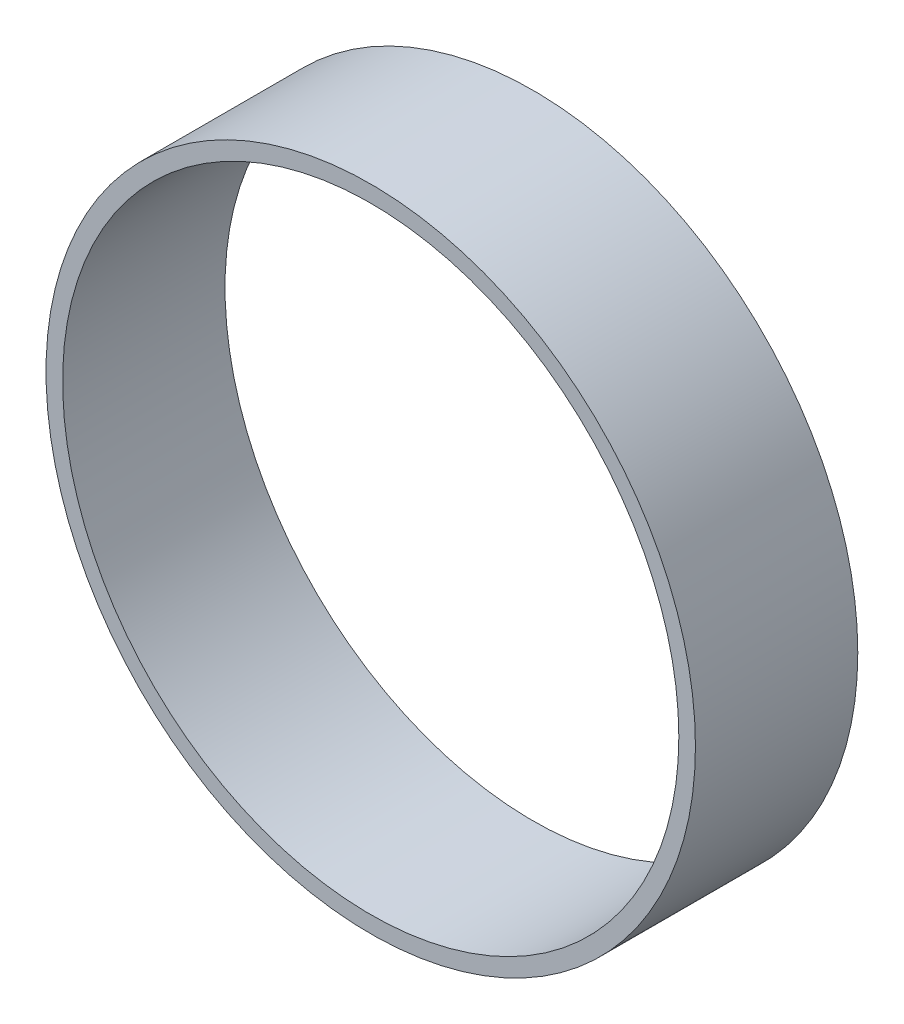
from build123d import *

# Parameters (mm, degrees)
SKETCH1_R         = 50.8
SKETCH1_R_2       = 48.2
BASESECTION_DEPTH = 12.7


with BuildPart() as part:
    # Sketch1 → BaseSection (new, symmetric)
    with BuildSketch(Plane.XY):
        Circle(SKETCH1_R)
        Circle(SKETCH1_R_2, mode=Mode.SUBTRACT)
    extrude(amount=BASESECTION_DEPTH, both=True)


solid = part.part
